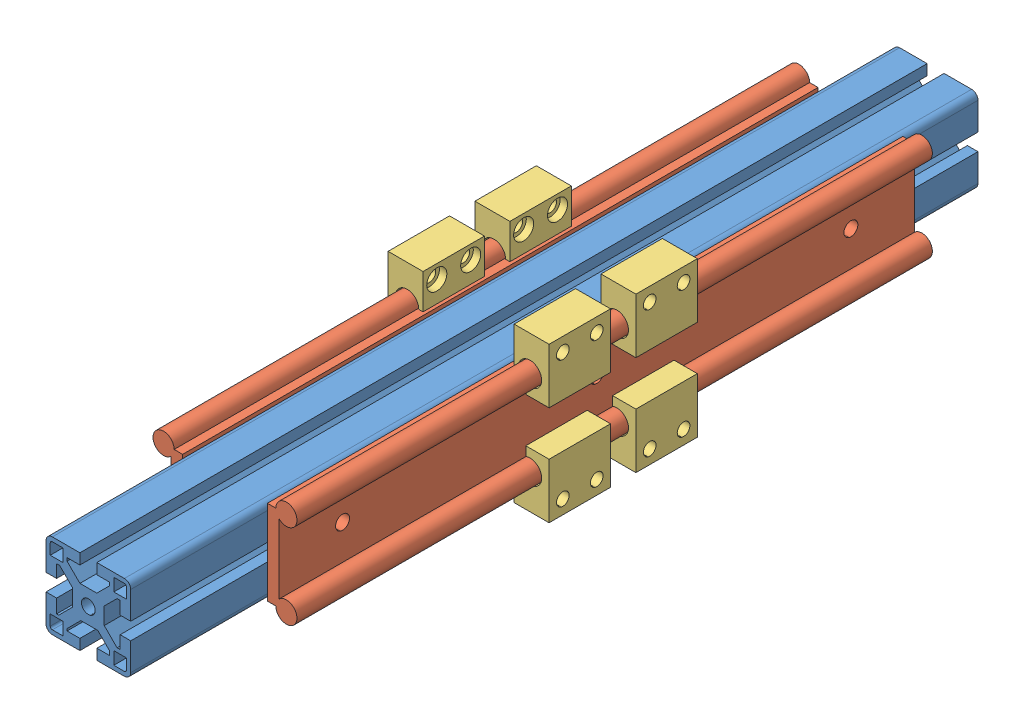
SolidWorks assembly Y-Soprte deslizaderas.SLDASM, configuration Predeterminado (file format 3800). Lengths in mm.
Overall size (76 73 400).
13 component instances, 3 part files, 0 mates.
Components (placement in the parent):
- Y-Pervil AL estructura 4x4x400-1: Y-Pervil AL estructura 4x4x400.SLDPRT [Predeterminado] at (0 0 65) x (0 1 0) z (0 0 -1) size (40 40 400)
- Y-Deslizaderas con patines-1: Y-Deslizaderas con patines.SLDASM [Predeterminado] at (0 0 -299.5) x (1 0 0) z (0 0 -1) size (18 73 300)
  - Y-Deslizadera doble-1: Y-Deslizadera doble.SLDPRT [Predeterminado] at (-22.75 0 0) x (0 -1 0) z (0 0 -1) size (50 14 300)
  - Y-Patin-1: Y-Patin.SLDPRT [Predeterminado] at (-29.75 -23.5 -185) x (0 1 0) z (0 0 1) size (26 16.5 29)
  - Y-Patin-3: Y-Patin.SLDPRT [Predeterminado] at (-29.75 23.5 -156) x (0 -1 0) z (0 0 -1) size (26 16.5 29)
  - Y-Patin-4: Y-Patin.SLDPRT [Predeterminado] at (-29.75 23.5 -115) x (0 -1 0) z (0 0 -1) size (26 16.5 29)
  - Y-Patin-6: Y-Patin.SLDPRT [Predeterminado] at (-29.75 -23.5 -144) x (0 1 0) z (0 0 1) size (26 16.5 29)
- Y-Deslizaderas con patines-2: Y-Deslizaderas con patines.SLDASM [Predeterminado] at (0 0 0.5) x (-1 0 0) z (0 0 1) size (18 73 300)
  - Y-Deslizadera doble-1: Y-Deslizadera doble.SLDPRT [Predeterminado] at (-22.75 0 0) x (0 -1 0) z (0 0 -1) size (50 14 300)
  - Y-Patin-1: Y-Patin.SLDPRT [Predeterminado] at (-29.75 -23.5 -185) x (0 1 0) z (0 0 1) size (26 16.5 29)
  - Y-Patin-3: Y-Patin.SLDPRT [Predeterminado] at (-29.75 23.5 -156) x (0 -1 0) z (0 0 -1) size (26 16.5 29)
  - Y-Patin-4: Y-Patin.SLDPRT [Predeterminado] at (-29.75 23.5 -115) x (0 -1 0) z (0 0 -1) size (26 16.5 29)
  - Y-Patin-6: Y-Patin.SLDPRT [Predeterminado] at (-29.75 -23.5 -144) x (0 1 0) z (0 0 1) size (26 16.5 29)
